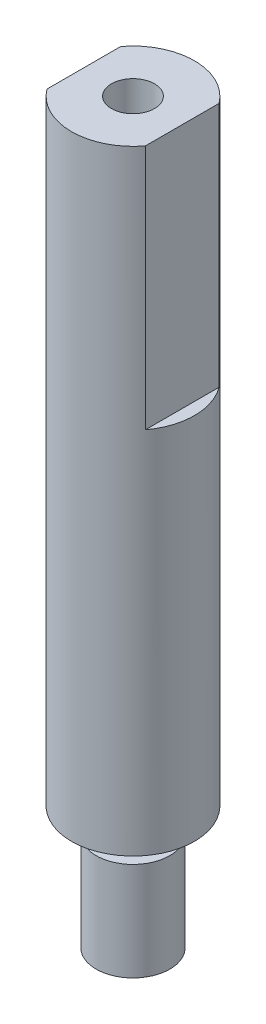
from build123d import *

# Parameters (mm, degrees)
SKETCH1_W                    = 2.5
SKETCH1_H                    = 25
CUT_EXTRUDE3_DEPTH           = 10
M2_2X0_45_TAPPED_HOLE1_D     = 1.75
M2_2X0_45_TAPPED_HOLE1_DEPTH = 3.5
M2_2X0_45_TAPPED_HOLE1_TIP   = 0.525753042
SKETCH4_R                    = 1
EXTRUDE1_DEPTH               = 1
SKETCH5_R                    = 1.5
EXTRUDE2_DEPTH               = 4


with BuildPart() as part:
    # Sketch1 → Revolve1 (revolve)
    with BuildSketch(Plane.XY, mode=Mode.PRIVATE) as revolve1_sk:
        with Locations((1.25, 12.5)):
            Rectangle(SKETCH1_W, SKETCH1_H)
    revolve(revolve1_sk.sketch.rotate(Axis((0, 52.943201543, 0), (0, -1, 0)), 90), axis=Axis((0, 52.943201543, 0), (0, -1, 0)))

    # Sketch2 → Cut-Extrude3 (cut)
    with BuildSketch(Plane(origin=(0, 25, 0), x_dir=(1, 0, 0), z_dir=(0, 1, 0))):
        with BuildLine():
            Line((-1.999878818, -1.500161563), (-1.999878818, 1.500161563))
            ThreePointArc((-1.999878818, 1.500161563), (-2.5, 0), (-1.999878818, -1.500161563))
        make_face()
        with BuildLine():
            Line((2.003348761, 1.495524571), (2.003348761, -1.495524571))
            ThreePointArc((2.003348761, -1.495524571), (2.5, 0), (2.003348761, 1.495524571))
        make_face()
    extrude(amount=-CUT_EXTRUDE3_DEPTH, mode=Mode.SUBTRACT)

    # M2.2x0.45 Tapped Hole1
    with Locations(Plane.ZX.offset(25)):
        with Locations((0, 0)):
            Hole(M2_2X0_45_TAPPED_HOLE1_D / 2, depth=M2_2X0_45_TAPPED_HOLE1_DEPTH)
            with Locations((0, 0, -(M2_2X0_45_TAPPED_HOLE1_DEPTH + M2_2X0_45_TAPPED_HOLE1_TIP / 2))):  # 118° drill point
                Cone(0, M2_2X0_45_TAPPED_HOLE1_D / 2, M2_2X0_45_TAPPED_HOLE1_TIP, mode=Mode.SUBTRACT)

    # Sketch4 → Extrude1 (add)
    with BuildSketch(Plane.XZ):
        with Locations(Location((0, 0, 0), (0, 0, 90))):
            Circle(SKETCH4_R)
    extrude(amount=EXTRUDE1_DEPTH)

    # Sketch5 → Extrude2 (add)
    with BuildSketch(Plane.XZ.offset(1)):
        with Locations(Location((0, 0, 0), (0, 0, 270))):
            Circle(SKETCH5_R)
    extrude(amount=EXTRUDE2_DEPTH)


solid = part.part
